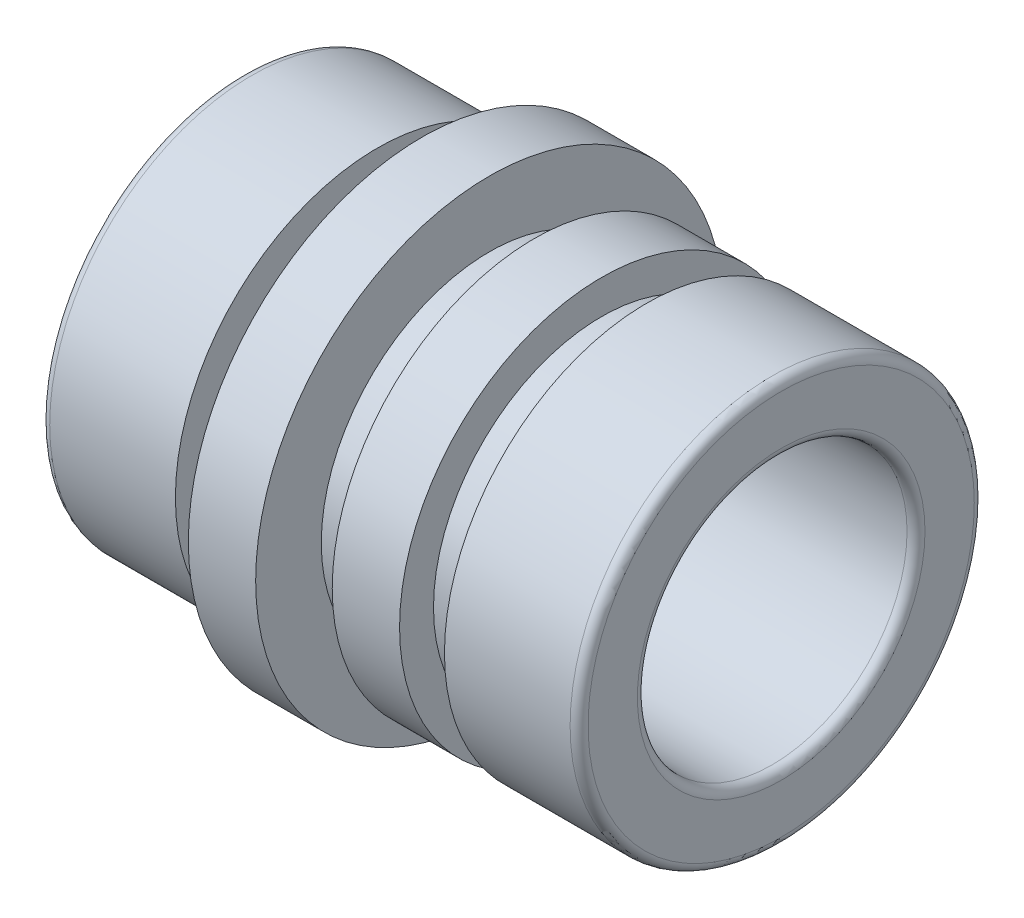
from build123d import *

# Parameters (mm, degrees)
FILLET1_R = 0.635


with BuildPart() as part:
    # Sketch1 → Base-Revolve (revolve)
    with BuildSketch(Plane(origin=(0, 15.24, 0), x_dir=(1, 0, 0), z_dir=(0, 0, 1)), mode=Mode.PRIVATE) as base_revolve_sk:
        Polygon((-12.7, -0.9652), (-3.175, -0.9652), (-3.175, -3.34645), (0, -3.34645), (0, 1.2954), (4.7625, 1.2954), (4.7625, -3.34645), (7.9375, -3.34645), (7.9375, -0.94615), (12.7, -0.94615), (12.7, -3.34645), (15.875, -3.34645), (15.875, -0.94615), (25.4, -0.94615), (25.4, -5.7023), (-12.7, -5.7023), align=None)
    revolve(base_revolve_sk.sketch.rotate(Axis((-36.83, 0, 0), (1, 0, 0)), 90), axis=Axis((-36.83, 0, 0), (1, 0, 0)))

    # Fillet1
    fillet1_edges = [part.edges().sort_by_distance(p)[0] for p in [
        (-12.7, 0, -14.2748),
        (25.4, 0, -14.29385),
        (25.4, 0, -9.5377),
        (-12.7, 0, -9.5377),
    ]]
    fillet(fillet1_edges, radius=FILLET1_R)


solid = part.part
